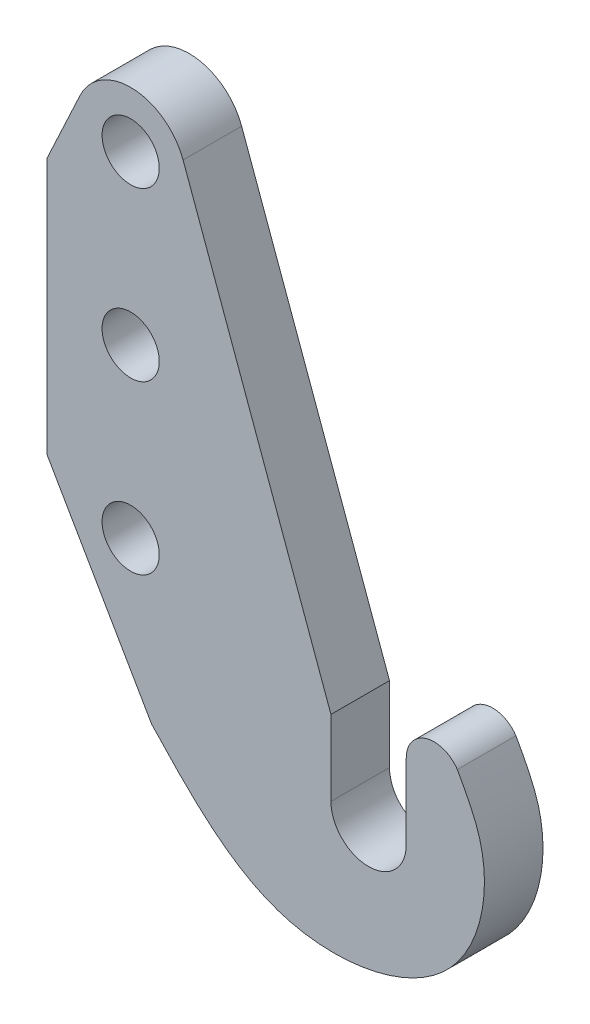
ISO-10303-21;
HEADER;
FILE_DESCRIPTION(('STEP AP214'),'2;1');
FILE_NAME('part.step','',(''),(''),'','','');
FILE_SCHEMA(('AUTOMOTIVE_DESIGN { 1 0 10303 214 1 1 1 1 }'));
ENDSEC;
DATA;
#1=APPLICATION_CONTEXT('core data for automotive mechanical design processes');
#2=APPLICATION_PROTOCOL_DEFINITION('international standard','automotive_design',2000,#1);
#3=PRODUCT_CONTEXT('',#1,'mechanical');
#4=PRODUCT('Part','Part','',(#3));
#5=PRODUCT_RELATED_PRODUCT_CATEGORY('part','',(#4));
#6=PRODUCT_DEFINITION_FORMATION('','',#4);
#7=PRODUCT_DEFINITION_CONTEXT('part definition',#1,'design');
#8=PRODUCT_DEFINITION('design','',#6,#7);
#9=PRODUCT_DEFINITION_SHAPE('','',#8);
#10=(LENGTH_UNIT() NAMED_UNIT(*) SI_UNIT(.MILLI.,.METRE.));
#11=(NAMED_UNIT(*) PLANE_ANGLE_UNIT() SI_UNIT($,.RADIAN.));
#12=(NAMED_UNIT(*) SI_UNIT($,.STERADIAN.) SOLID_ANGLE_UNIT());
#13=UNCERTAINTY_MEASURE_WITH_UNIT(LENGTH_MEASURE(1.E-05),#10,'distance_accuracy_value','');
#14=(GEOMETRIC_REPRESENTATION_CONTEXT(3) GLOBAL_UNCERTAINTY_ASSIGNED_CONTEXT((#13)) GLOBAL_UNIT_ASSIGNED_CONTEXT((#10,
#11,#12)) REPRESENTATION_CONTEXT('',''));
#15=CARTESIAN_POINT('',(0.,0.,0.));
#16=DIRECTION('',(0.,0.,1.));
#17=DIRECTION('',(1.,0.,0.));
#18=AXIS2_PLACEMENT_3D('',#15,#16,#17);
#19=CARTESIAN_POINT('',(90.2722291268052,-210.089311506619,21.));
#20=DIRECTION('',(0.,0.,-1.));
#21=DIRECTION('',(-1.,0.,0.));
#22=AXIS2_PLACEMENT_3D('',#19,#20,#21);
#23=PLANE('',#22);
#24=CARTESIAN_POINT('',(0.,-60.0000000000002,21.));
#25=DIRECTION('',(0.,0.,1.));
#26=DIRECTION('',(1.,0.,0.));
#27=AXIS2_PLACEMENT_3D('',#24,#25,#26);
#28=CIRCLE('',#27,10.25);
#29=CARTESIAN_POINT('',(-10.25,-60.0000000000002,21.));
#30=VERTEX_POINT('',#29);
#31=EDGE_CURVE('E244',#30,#30,#28,.T.);
#32=ORIENTED_EDGE('',*,*,#31,.F.);
#33=EDGE_LOOP('',(#32));
#34=FACE_BOUND('',#33,.T.);
#35=DIRECTION('',(0.500000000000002,-0.866025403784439,0.));
#36=VECTOR('',#35,1.);
#37=CARTESIAN_POINT('',(-30.0000000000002,-109.011175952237,21.));
#38=LINE('',#37,#36);
#39=CARTESIAN_POINT('',(-30.0000000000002,-109.011175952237,21.));
#40=VERTEX_POINT('',#39);
#41=CARTESIAN_POINT('',(7.49999999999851,-173.96308123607,21.));
#42=VERTEX_POINT('',#41);
#43=EDGE_CURVE('E166',#40,#42,#38,.T.);
#44=ORIENTED_EDGE('',*,*,#43,.T.);
#45=CARTESIAN_POINT('',(7.49999999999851,-173.96308123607,21.));
#46=CARTESIAN_POINT('',(21.9655402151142,-189.440634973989,20.9999999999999));
#47=CARTESIAN_POINT('',(51.0184942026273,-220.526142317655,21.));
#48=CARTESIAN_POINT('',(120.643530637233,-207.237177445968,21.));
#49=CARTESIAN_POINT('',(130.77861143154,-158.05215601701,21.));
#50=CARTESIAN_POINT('',(120.367683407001,-139.149758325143,21.));
#51=CARTESIAN_POINT('',(117.121833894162,-133.256495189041,21.));
#52=B_SPLINE_CURVE_WITH_KNOTS('',3,(#45,#46,#47,#48,#49,#50,#51),.UNSPECIFIED.,.F.,.F.,(4,1,1,1,
4),(0.,0.32627953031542,0.655307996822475,0.892534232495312,1.),.UNSPECIFIED.);
#53=CARTESIAN_POINT('',(117.121833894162,-133.256495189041,21.));
#54=VERTEX_POINT('',#53);
#55=EDGE_CURVE('E134',#42,#54,#52,.T.);
#56=ORIENTED_EDGE('',*,*,#55,.T.);
#57=CARTESIAN_POINT('',(108.806974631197,-138.811953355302,21.));
#58=DIRECTION('',(0.,0.,1.));
#59=DIRECTION('',(1.,0.,0.));
#60=AXIS2_PLACEMENT_3D('',#57,#58,#59);
#61=CIRCLE('',#60,10.);
#62=CARTESIAN_POINT('',(98.8069746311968,-138.811953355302,21.));
#63=VERTEX_POINT('',#62);
#64=EDGE_CURVE('E172',#54,#63,#61,.T.);
#65=ORIENTED_EDGE('',*,*,#64,.T.);
#66=DIRECTION('',(0.,-1.,0.));
#67=VECTOR('',#66,1.);
#68=CARTESIAN_POINT('',(98.8069746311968,-138.811953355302,21.));
#69=LINE('',#68,#67);
#70=CARTESIAN_POINT('',(98.8069746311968,-165.811953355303,21.));
#71=VERTEX_POINT('',#70);
#72=EDGE_CURVE('E259',#63,#71,#69,.T.);
#73=ORIENTED_EDGE('',*,*,#72,.T.);
#74=CARTESIAN_POINT('',(85.3069746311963,-165.811953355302,21.));
#75=DIRECTION('',(0.,0.,-1.));
#76=DIRECTION('',(1.,0.,0.));
#77=AXIS2_PLACEMENT_3D('',#74,#75,#76);
#78=CIRCLE('',#77,13.5);
#79=CARTESIAN_POINT('',(71.8069746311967,-165.811953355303,21.));
#80=VERTEX_POINT('',#79);
#81=EDGE_CURVE('E260',#71,#80,#78,.T.);
#82=ORIENTED_EDGE('',*,*,#81,.T.);
#83=DIRECTION('',(0.,1.,0.));
#84=VECTOR('',#83,1.);
#85=CARTESIAN_POINT('',(71.8069746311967,-138.811953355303,20.9999999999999));
#86=LINE('',#85,#84);
#87=CARTESIAN_POINT('',(71.8069746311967,-138.811953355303,20.9999999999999));
#88=VERTEX_POINT('',#87);
#89=EDGE_CURVE('E262',#80,#88,#86,.T.);
#90=ORIENTED_EDGE('',*,*,#89,.T.);
#91=DIRECTION('',(-0.34202014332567,0.939692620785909,0.));
#92=VECTOR('',#91,1.);
#93=CARTESIAN_POINT('',(18.7938524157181,6.84040286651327,21.));
#94=LINE('',#93,#92);
#95=CARTESIAN_POINT('',(18.7938524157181,6.84040286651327,21.));
#96=VERTEX_POINT('',#95);
#97=EDGE_CURVE('E266',#88,#96,#94,.T.);
#98=ORIENTED_EDGE('',*,*,#97,.T.);
#99=CARTESIAN_POINT('',(0.,0.,21.));
#100=DIRECTION('',(0.,0.,1.));
#101=DIRECTION('',(1.,0.,0.));
#102=AXIS2_PLACEMENT_3D('',#99,#100,#101);
#103=CIRCLE('',#102,20.);
#104=CARTESIAN_POINT('',(-18.1261557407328,8.45236523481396,21.));
#105=VERTEX_POINT('',#104);
#106=EDGE_CURVE('E268',#96,#105,#103,.T.);
#107=ORIENTED_EDGE('',*,*,#106,.T.);
#108=DIRECTION('',(-0.4226182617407,-0.90630778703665,0.));
#109=VECTOR('',#108,1.);
#110=CARTESIAN_POINT('',(-18.1261557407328,8.45236523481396,21.));
#111=LINE('',#110,#109);
#112=CARTESIAN_POINT('',(-30.0000000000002,-17.0111759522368,21.));
#113=VERTEX_POINT('',#112);
#114=EDGE_CURVE('E63',#105,#113,#111,.T.);
#115=ORIENTED_EDGE('',*,*,#114,.T.);
#116=DIRECTION('',(0.,-1.,0.));
#117=VECTOR('',#116,1.);
#118=CARTESIAN_POINT('',(-30.0000000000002,-17.0111759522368,21.));
#119=LINE('',#118,#117);
#120=EDGE_CURVE('E58',#113,#40,#119,.T.);
#121=ORIENTED_EDGE('',*,*,#120,.T.);
#122=EDGE_LOOP('',(#44,#56,#65,#73,#82,#90,#98,#107,#115,#121));
#123=FACE_BOUND('',#122,.T.);
#124=CARTESIAN_POINT('',(0.,0.,21.));
#125=DIRECTION('',(0.,0.,1.));
#126=DIRECTION('',(1.,0.,0.));
#127=AXIS2_PLACEMENT_3D('',#124,#125,#126);
#128=CIRCLE('',#127,10.25);
#129=CARTESIAN_POINT('',(-10.25,0.,21.));
#130=VERTEX_POINT('',#129);
#131=EDGE_CURVE('E139',#130,#130,#128,.T.);
#132=ORIENTED_EDGE('',*,*,#131,.F.);
#133=EDGE_LOOP('',(#132));
#134=FACE_BOUND('',#133,.T.);
#135=CARTESIAN_POINT('',(0.,-120.,21.));
#136=DIRECTION('',(0.,0.,1.));
#137=DIRECTION('',(1.,0.,0.));
#138=AXIS2_PLACEMENT_3D('',#135,#136,#137);
#139=CIRCLE('',#138,10.25);
#140=CARTESIAN_POINT('',(-10.25,-120.,21.));
#141=VERTEX_POINT('',#140);
#142=EDGE_CURVE('E233',#141,#141,#139,.T.);
#143=ORIENTED_EDGE('',*,*,#142,.F.);
#144=EDGE_LOOP('',(#143));
#145=FACE_BOUND('',#144,.T.);
#146=ADVANCED_FACE('F43',(#34,#123,#134,#145),#23,.F.);
#147=CARTESIAN_POINT('',(90.2722291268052,-210.089311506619,0.));
#148=DIRECTION('',(0.,0.,-1.));
#149=DIRECTION('',(-1.,0.,0.));
#150=AXIS2_PLACEMENT_3D('',#147,#148,#149);
#151=PLANE('',#150);
#152=CARTESIAN_POINT('',(0.,-60.0000000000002,0.));
#153=DIRECTION('',(0.,0.,1.));
#154=DIRECTION('',(1.,0.,0.));
#155=AXIS2_PLACEMENT_3D('',#152,#153,#154);
#156=CIRCLE('',#155,10.25);
#157=CARTESIAN_POINT('',(-10.25,-60.0000000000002,0.));
#158=VERTEX_POINT('',#157);
#159=EDGE_CURVE('E239',#158,#158,#156,.T.);
#160=ORIENTED_EDGE('',*,*,#159,.T.);
#161=EDGE_LOOP('',(#160));
#162=FACE_BOUND('',#161,.T.);
#163=DIRECTION('',(0.500000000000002,-0.866025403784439,0.));
#164=VECTOR('',#163,1.);
#165=CARTESIAN_POINT('',(-30.0000000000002,-109.011175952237,0.));
#166=LINE('',#165,#164);
#167=CARTESIAN_POINT('',(-30.0000000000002,-109.011175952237,0.));
#168=VERTEX_POINT('',#167);
#169=CARTESIAN_POINT('',(7.49999999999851,-173.963081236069,0.));
#170=VERTEX_POINT('',#169);
#171=EDGE_CURVE('E125',#168,#170,#166,.T.);
#172=ORIENTED_EDGE('',*,*,#171,.F.);
#173=DIRECTION('',(0.,-1.,0.));
#174=VECTOR('',#173,1.);
#175=CARTESIAN_POINT('',(-30.0000000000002,-17.0111759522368,0.));
#176=LINE('',#175,#174);
#177=CARTESIAN_POINT('',(-30.0000000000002,-17.0111759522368,0.));
#178=VERTEX_POINT('',#177);
#179=EDGE_CURVE('E164',#178,#168,#176,.T.);
#180=ORIENTED_EDGE('',*,*,#179,.F.);
#181=DIRECTION('',(-0.4226182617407,-0.90630778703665,0.));
#182=VECTOR('',#181,1.);
#183=CARTESIAN_POINT('',(-18.1261557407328,8.45236523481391,0.));
#184=LINE('',#183,#182);
#185=CARTESIAN_POINT('',(-18.1261557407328,8.45236523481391,0.));
#186=VERTEX_POINT('',#185);
#187=EDGE_CURVE('E162',#186,#178,#184,.T.);
#188=ORIENTED_EDGE('',*,*,#187,.F.);
#189=CARTESIAN_POINT('',(0.,0.,0.));
#190=DIRECTION('',(0.,0.,1.));
#191=DIRECTION('',(1.,0.,0.));
#192=AXIS2_PLACEMENT_3D('',#189,#190,#191);
#193=CIRCLE('',#192,20.);
#194=CARTESIAN_POINT('',(18.7938524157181,6.84040286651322,0.));
#195=VERTEX_POINT('',#194);
#196=EDGE_CURVE('E160',#195,#186,#193,.T.);
#197=ORIENTED_EDGE('',*,*,#196,.F.);
#198=DIRECTION('',(-0.34202014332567,0.939692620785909,0.));
#199=VECTOR('',#198,1.);
#200=CARTESIAN_POINT('',(18.7938524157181,6.84040286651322,0.));
#201=LINE('',#200,#199);
#202=CARTESIAN_POINT('',(71.8069746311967,-138.811953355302,-1.11022302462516E-13));
#203=VERTEX_POINT('',#202);
#204=EDGE_CURVE('E158',#203,#195,#201,.T.);
#205=ORIENTED_EDGE('',*,*,#204,.F.);
#206=DIRECTION('',(0.,1.,0.));
#207=VECTOR('',#206,1.);
#208=CARTESIAN_POINT('',(71.8069746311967,-138.811953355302,-1.11022302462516E-13));
#209=LINE('',#208,#207);
#210=CARTESIAN_POINT('',(71.8069746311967,-165.811953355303,0.));
#211=VERTEX_POINT('',#210);
#212=EDGE_CURVE('E156',#211,#203,#209,.T.);
#213=ORIENTED_EDGE('',*,*,#212,.F.);
#214=CARTESIAN_POINT('',(85.3069746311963,-165.811953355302,0.));
#215=DIRECTION('',(0.,0.,-1.));
#216=DIRECTION('',(1.,0.,0.));
#217=AXIS2_PLACEMENT_3D('',#214,#215,#216);
#218=CIRCLE('',#217,13.5);
#219=CARTESIAN_POINT('',(98.8069746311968,-165.811953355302,0.));
#220=VERTEX_POINT('',#219);
#221=EDGE_CURVE('E154',#220,#211,#218,.T.);
#222=ORIENTED_EDGE('',*,*,#221,.F.);
#223=DIRECTION('',(0.,-1.,0.));
#224=VECTOR('',#223,1.);
#225=CARTESIAN_POINT('',(98.8069746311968,-138.811953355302,0.));
#226=LINE('',#225,#224);
#227=CARTESIAN_POINT('',(98.8069746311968,-138.811953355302,0.));
#228=VERTEX_POINT('',#227);
#229=EDGE_CURVE('E152',#228,#220,#226,.T.);
#230=ORIENTED_EDGE('',*,*,#229,.F.);
#231=CARTESIAN_POINT('',(108.806974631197,-138.811953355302,0.));
#232=DIRECTION('',(0.,0.,1.));
#233=DIRECTION('',(1.,0.,0.));
#234=AXIS2_PLACEMENT_3D('',#231,#232,#233);
#235=CIRCLE('',#234,10.);
#236=CARTESIAN_POINT('',(117.121833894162,-133.25649518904,0.));
#237=VERTEX_POINT('',#236);
#238=EDGE_CURVE('E127',#237,#228,#235,.T.);
#239=ORIENTED_EDGE('',*,*,#238,.F.);
#240=CARTESIAN_POINT('',(7.49999999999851,-173.963081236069,0.));
#241=CARTESIAN_POINT('',(21.9655402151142,-189.440634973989,0.));
#242=CARTESIAN_POINT('',(51.0184942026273,-220.526142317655,0.));
#243=CARTESIAN_POINT('',(120.643530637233,-207.237177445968,0.));
#244=CARTESIAN_POINT('',(130.77861143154,-158.05215601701,0.));
#245=CARTESIAN_POINT('',(120.367683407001,-139.149758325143,0.));
#246=CARTESIAN_POINT('',(117.121833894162,-133.25649518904,0.));
#247=B_SPLINE_CURVE_WITH_KNOTS('',3,(#240,#241,#242,#243,#244,#245,#246),.UNSPECIFIED.,.F.,.F.,
(4,1,1,1,4),(0.,0.32627953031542,0.655307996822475,0.892534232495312,1.),.UNSPECIFIED.);
#248=EDGE_CURVE('E120',#170,#237,#247,.T.);
#249=ORIENTED_EDGE('',*,*,#248,.F.);
#250=EDGE_LOOP('',(#172,#180,#188,#197,#205,#213,#222,#230,#239,#249));
#251=FACE_BOUND('',#250,.T.);
#252=CARTESIAN_POINT('',(0.,0.,0.));
#253=DIRECTION('',(0.,0.,1.));
#254=DIRECTION('',(1.,0.,0.));
#255=AXIS2_PLACEMENT_3D('',#252,#253,#254);
#256=CIRCLE('',#255,10.25);
#257=CARTESIAN_POINT('',(-10.25,0.,0.));
#258=VERTEX_POINT('',#257);
#259=EDGE_CURVE('E142',#258,#258,#256,.T.);
#260=ORIENTED_EDGE('',*,*,#259,.T.);
#261=EDGE_LOOP('',(#260));
#262=FACE_BOUND('',#261,.T.);
#263=CARTESIAN_POINT('',(-1.77635683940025E-12,-120.,0.));
#264=DIRECTION('',(0.,0.,1.));
#265=DIRECTION('',(1.,0.,0.));
#266=AXIS2_PLACEMENT_3D('',#263,#264,#265);
#267=CIRCLE('',#266,10.25);
#268=CARTESIAN_POINT('',(-10.25,-120.,0.));
#269=VERTEX_POINT('',#268);
#270=EDGE_CURVE('E236',#269,#269,#267,.T.);
#271=ORIENTED_EDGE('',*,*,#270,.T.);
#272=EDGE_LOOP('',(#271));
#273=FACE_BOUND('',#272,.T.);
#274=ADVANCED_FACE('F121',(#162,#251,#262,#273),#151,.T.);
#275=CARTESIAN_POINT('',(-30.0000000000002,-109.011175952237,21.));
#276=DIRECTION('',(0.866025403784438,0.500000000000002,0.));
#277=DIRECTION('',(-0.500000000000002,0.866025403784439,0.));
#278=AXIS2_PLACEMENT_3D('',#275,#276,#277);
#279=PLANE('',#278);
#280=ORIENTED_EDGE('',*,*,#171,.T.);
#281=DIRECTION('',(0.,0.,-1.));
#282=VECTOR('',#281,1.);
#283=CARTESIAN_POINT('',(7.49999999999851,-173.96308123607,21.));
#284=LINE('',#283,#282);
#285=EDGE_CURVE('E13',#42,#170,#284,.T.);
#286=ORIENTED_EDGE('',*,*,#285,.F.);
#287=ORIENTED_EDGE('',*,*,#43,.F.);
#288=DIRECTION('',(0.,0.,-1.));
#289=VECTOR('',#288,1.);
#290=CARTESIAN_POINT('',(-30.0000000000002,-109.011175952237,21.));
#291=LINE('',#290,#289);
#292=EDGE_CURVE('E138',#40,#168,#291,.T.);
#293=ORIENTED_EDGE('',*,*,#292,.T.);
#294=EDGE_LOOP('',(#280,#286,#287,#293));
#295=FACE_BOUND('',#294,.T.);
#296=ADVANCED_FACE('F45',(#295),#279,.F.);
#297=DIRECTION('',(0.,0.,-1.));
#298=VECTOR('',#297,1.);
#299=SURFACE_OF_LINEAR_EXTRUSION('',#52,#298);
#300=ORIENTED_EDGE('',*,*,#248,.T.);
#301=DIRECTION('',(0.,0.,-1.));
#302=VECTOR('',#301,1.);
#303=CARTESIAN_POINT('',(117.121833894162,-133.256495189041,21.));
#304=LINE('',#303,#302);
#305=EDGE_CURVE('E51',#54,#237,#304,.T.);
#306=ORIENTED_EDGE('',*,*,#305,.F.);
#307=ORIENTED_EDGE('',*,*,#55,.F.);
#308=ORIENTED_EDGE('',*,*,#285,.T.);
#309=EDGE_LOOP('',(#300,#306,#307,#308));
#310=FACE_BOUND('',#309,.T.);
#311=ADVANCED_FACE('F133',(#310),#299,.F.);
#312=CARTESIAN_POINT('',(108.806974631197,-138.811953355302,21.));
#313=DIRECTION('',(0.,0.,-1.));
#314=DIRECTION('',(-1.,0.,0.));
#315=AXIS2_PLACEMENT_3D('',#312,#313,#314);
#316=CYLINDRICAL_SURFACE('',#315,10.);
#317=ORIENTED_EDGE('',*,*,#238,.T.);
#318=DIRECTION('',(0.,0.,-1.));
#319=VECTOR('',#318,1.);
#320=CARTESIAN_POINT('',(98.8069746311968,-138.811953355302,21.));
#321=LINE('',#320,#319);
#322=EDGE_CURVE('E256',#63,#228,#321,.T.);
#323=ORIENTED_EDGE('',*,*,#322,.F.);
#324=ORIENTED_EDGE('',*,*,#64,.F.);
#325=ORIENTED_EDGE('',*,*,#305,.T.);
#326=EDGE_LOOP('',(#317,#323,#324,#325));
#327=FACE_BOUND('',#326,.T.);
#328=ADVANCED_FACE('F179',(#327),#316,.T.);
#329=CARTESIAN_POINT('',(98.8069746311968,-138.811953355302,21.));
#330=DIRECTION('',(1.,0.,0.));
#331=DIRECTION('',(0.,0.,-1.));
#332=AXIS2_PLACEMENT_3D('',#329,#330,#331);
#333=PLANE('',#332);
#334=ORIENTED_EDGE('',*,*,#229,.T.);
#335=DIRECTION('',(0.,0.,-1.));
#336=VECTOR('',#335,1.);
#337=CARTESIAN_POINT('',(98.8069746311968,-165.811953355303,21.));
#338=LINE('',#337,#336);
#339=EDGE_CURVE('E288',#71,#220,#338,.T.);
#340=ORIENTED_EDGE('',*,*,#339,.F.);
#341=ORIENTED_EDGE('',*,*,#72,.F.);
#342=ORIENTED_EDGE('',*,*,#322,.T.);
#343=EDGE_LOOP('',(#334,#340,#341,#342));
#344=FACE_BOUND('',#343,.T.);
#345=ADVANCED_FACE('F182',(#344),#333,.F.);
#346=CARTESIAN_POINT('',(85.3069746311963,-165.811953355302,21.));
#347=DIRECTION('',(0.,0.,-1.));
#348=DIRECTION('',(-1.,0.,0.));
#349=AXIS2_PLACEMENT_3D('',#346,#347,#348);
#350=CYLINDRICAL_SURFACE('',#349,13.5);
#351=ORIENTED_EDGE('',*,*,#221,.T.);
#352=DIRECTION('',(0.,0.,-1.));
#353=VECTOR('',#352,1.);
#354=CARTESIAN_POINT('',(71.8069746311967,-165.811953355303,21.));
#355=LINE('',#354,#353);
#356=EDGE_CURVE('E285',#80,#211,#355,.T.);
#357=ORIENTED_EDGE('',*,*,#356,.F.);
#358=ORIENTED_EDGE('',*,*,#81,.F.);
#359=ORIENTED_EDGE('',*,*,#339,.T.);
#360=EDGE_LOOP('',(#351,#357,#358,#359));
#361=FACE_BOUND('',#360,.T.);
#362=ADVANCED_FACE('F186',(#361),#350,.F.);
#363=CARTESIAN_POINT('',(71.8069746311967,-138.811953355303,20.9999999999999));
#364=DIRECTION('',(-1.,0.,0.));
#365=DIRECTION('',(0.,0.,1.));
#366=AXIS2_PLACEMENT_3D('',#363,#364,#365);
#367=PLANE('',#366);
#368=ORIENTED_EDGE('',*,*,#212,.T.);
#369=DIRECTION('',(0.,0.,-1.));
#370=VECTOR('',#369,1.);
#371=CARTESIAN_POINT('',(71.8069746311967,-138.811953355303,20.9999999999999));
#372=LINE('',#371,#370);
#373=EDGE_CURVE('E282',#88,#203,#372,.T.);
#374=ORIENTED_EDGE('',*,*,#373,.F.);
#375=ORIENTED_EDGE('',*,*,#89,.F.);
#376=ORIENTED_EDGE('',*,*,#356,.T.);
#377=EDGE_LOOP('',(#368,#374,#375,#376));
#378=FACE_BOUND('',#377,.T.);
#379=ADVANCED_FACE('F190',(#378),#367,.F.);
#380=CARTESIAN_POINT('',(18.7938524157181,6.84040286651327,21.));
#381=DIRECTION('',(-0.939692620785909,-0.34202014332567,0.));
#382=DIRECTION('',(0.34202014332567,-0.939692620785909,0.));
#383=AXIS2_PLACEMENT_3D('',#380,#381,#382);
#384=PLANE('',#383);
#385=ORIENTED_EDGE('',*,*,#204,.T.);
#386=DIRECTION('',(0.,0.,-1.));
#387=VECTOR('',#386,1.);
#388=CARTESIAN_POINT('',(18.7938524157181,6.84040286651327,21.));
#389=LINE('',#388,#387);
#390=EDGE_CURVE('E279',#96,#195,#389,.T.);
#391=ORIENTED_EDGE('',*,*,#390,.F.);
#392=ORIENTED_EDGE('',*,*,#97,.F.);
#393=ORIENTED_EDGE('',*,*,#373,.T.);
#394=EDGE_LOOP('',(#385,#391,#392,#393));
#395=FACE_BOUND('',#394,.T.);
#396=ADVANCED_FACE('F194',(#395),#384,.F.);
#397=CARTESIAN_POINT('',(0.,0.,21.));
#398=DIRECTION('',(0.,0.,-1.));
#399=DIRECTION('',(-1.,0.,0.));
#400=AXIS2_PLACEMENT_3D('',#397,#398,#399);
#401=CYLINDRICAL_SURFACE('',#400,20.);
#402=ORIENTED_EDGE('',*,*,#196,.T.);
#403=DIRECTION('',(0.,0.,-1.));
#404=VECTOR('',#403,1.);
#405=CARTESIAN_POINT('',(-18.1261557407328,8.45236523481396,21.));
#406=LINE('',#405,#404);
#407=EDGE_CURVE('E276',#105,#186,#406,.T.);
#408=ORIENTED_EDGE('',*,*,#407,.F.);
#409=ORIENTED_EDGE('',*,*,#106,.F.);
#410=ORIENTED_EDGE('',*,*,#390,.T.);
#411=EDGE_LOOP('',(#402,#408,#409,#410));
#412=FACE_BOUND('',#411,.T.);
#413=ADVANCED_FACE('F198',(#412),#401,.T.);
#414=CARTESIAN_POINT('',(-18.1261557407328,8.45236523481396,21.));
#415=DIRECTION('',(0.90630778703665,-0.4226182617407,0.));
#416=DIRECTION('',(0.422618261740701,0.906307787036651,0.));
#417=AXIS2_PLACEMENT_3D('',#414,#415,#416);
#418=PLANE('',#417);
#419=ORIENTED_EDGE('',*,*,#187,.T.);
#420=DIRECTION('',(0.,0.,-1.));
#421=VECTOR('',#420,1.);
#422=CARTESIAN_POINT('',(-30.0000000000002,-17.0111759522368,21.));
#423=LINE('',#422,#421);
#424=EDGE_CURVE('E273',#113,#178,#423,.T.);
#425=ORIENTED_EDGE('',*,*,#424,.F.);
#426=ORIENTED_EDGE('',*,*,#114,.F.);
#427=ORIENTED_EDGE('',*,*,#407,.T.);
#428=EDGE_LOOP('',(#419,#425,#426,#427));
#429=FACE_BOUND('',#428,.T.);
#430=ADVANCED_FACE('F202',(#429),#418,.F.);
#431=CARTESIAN_POINT('',(-30.0000000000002,-17.0111759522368,21.));
#432=DIRECTION('',(1.,0.,0.));
#433=DIRECTION('',(0.,1.,0.));
#434=AXIS2_PLACEMENT_3D('',#431,#432,#433);
#435=PLANE('',#434);
#436=ORIENTED_EDGE('',*,*,#179,.T.);
#437=ORIENTED_EDGE('',*,*,#292,.F.);
#438=ORIENTED_EDGE('',*,*,#120,.F.);
#439=ORIENTED_EDGE('',*,*,#424,.T.);
#440=EDGE_LOOP('',(#436,#437,#438,#439));
#441=FACE_BOUND('',#440,.T.);
#442=ADVANCED_FACE('F206',(#441),#435,.F.);
#443=CARTESIAN_POINT('',(0.,0.,21.));
#444=DIRECTION('',(0.,0.,-1.));
#445=DIRECTION('',(-1.,0.,0.));
#446=AXIS2_PLACEMENT_3D('',#443,#444,#445);
#447=CYLINDRICAL_SURFACE('',#446,10.25);
#448=CARTESIAN_POINT('',(-10.25,0.,21.));
#449=CARTESIAN_POINT('',(-10.25,0.,20.78125));
#450=CARTESIAN_POINT('',(-10.25,0.,20.5625));
#451=CARTESIAN_POINT('',(-10.25,0.,20.125));
#452=CARTESIAN_POINT('',(-10.25,0.,19.90625));
#453=CARTESIAN_POINT('',(-10.25,0.,19.46875));
#454=CARTESIAN_POINT('',(-10.25,0.,19.25));
#455=CARTESIAN_POINT('',(-10.25,0.,18.8125));
#456=CARTESIAN_POINT('',(-10.25,0.,18.59375));
#457=CARTESIAN_POINT('',(-10.25,0.,18.15625));
#458=CARTESIAN_POINT('',(-10.25,0.,17.9375));
#459=CARTESIAN_POINT('',(-10.25,0.,17.5));
#460=CARTESIAN_POINT('',(-10.25,0.,17.28125));
#461=CARTESIAN_POINT('',(-10.25,0.,16.84375));
#462=CARTESIAN_POINT('',(-10.25,0.,16.625));
#463=CARTESIAN_POINT('',(-10.25,0.,16.1875));
#464=CARTESIAN_POINT('',(-10.25,0.,15.96875));
#465=CARTESIAN_POINT('',(-10.25,0.,15.53125));
#466=CARTESIAN_POINT('',(-10.25,0.,15.3125));
#467=CARTESIAN_POINT('',(-10.25,0.,14.875));
#468=CARTESIAN_POINT('',(-10.25,0.,14.65625));
#469=CARTESIAN_POINT('',(-10.25,0.,14.21875));
#470=CARTESIAN_POINT('',(-10.25,0.,14.));
#471=CARTESIAN_POINT('',(-10.25,0.,13.5625));
#472=CARTESIAN_POINT('',(-10.25,0.,13.34375));
#473=CARTESIAN_POINT('',(-10.25,0.,12.90625));
#474=CARTESIAN_POINT('',(-10.25,0.,12.6875));
#475=CARTESIAN_POINT('',(-10.25,0.,12.25));
#476=CARTESIAN_POINT('',(-10.25,0.,12.03125));
#477=CARTESIAN_POINT('',(-10.25,0.,11.59375));
#478=CARTESIAN_POINT('',(-10.25,0.,11.375));
#479=CARTESIAN_POINT('',(-10.25,0.,10.9375));
#480=CARTESIAN_POINT('',(-10.25,0.,10.71875));
#481=CARTESIAN_POINT('',(-10.25,0.,10.28125));
#482=CARTESIAN_POINT('',(-10.25,0.,10.0625));
#483=CARTESIAN_POINT('',(-10.25,0.,9.62500000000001));
#484=CARTESIAN_POINT('',(-10.25,0.,9.40625000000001));
#485=CARTESIAN_POINT('',(-10.25,0.,8.96875000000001));
#486=CARTESIAN_POINT('',(-10.25,0.,8.75));
#487=CARTESIAN_POINT('',(-10.25,0.,8.3125));
#488=CARTESIAN_POINT('',(-10.25,0.,8.09375));
#489=CARTESIAN_POINT('',(-10.25,0.,7.65625));
#490=CARTESIAN_POINT('',(-10.25,0.,7.4375));
#491=CARTESIAN_POINT('',(-10.25,0.,7.));
#492=CARTESIAN_POINT('',(-10.25,0.,6.78125));
#493=CARTESIAN_POINT('',(-10.25,0.,6.34375));
#494=CARTESIAN_POINT('',(-10.25,0.,6.125));
#495=CARTESIAN_POINT('',(-10.25,0.,5.6875));
#496=CARTESIAN_POINT('',(-10.25,0.,5.46875));
#497=CARTESIAN_POINT('',(-10.25,0.,5.03125));
#498=CARTESIAN_POINT('',(-10.25,0.,4.8125));
#499=CARTESIAN_POINT('',(-10.25,0.,4.375));
#500=CARTESIAN_POINT('',(-10.25,0.,4.15625));
#501=CARTESIAN_POINT('',(-10.25,0.,3.71875));
#502=CARTESIAN_POINT('',(-10.25,0.,3.5));
#503=CARTESIAN_POINT('',(-10.25,0.,3.0625));
#504=CARTESIAN_POINT('',(-10.25,0.,2.84375));
#505=CARTESIAN_POINT('',(-10.25,0.,2.40625));
#506=CARTESIAN_POINT('',(-10.25,0.,2.1875));
#507=CARTESIAN_POINT('',(-10.25,0.,1.75));
#508=CARTESIAN_POINT('',(-10.25,0.,1.53125));
#509=CARTESIAN_POINT('',(-10.25,0.,1.09375));
#510=CARTESIAN_POINT('',(-10.25,0.,0.874999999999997));
#511=CARTESIAN_POINT('',(-10.25,0.,0.437499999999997));
#512=CARTESIAN_POINT('',(-10.25,0.,0.218749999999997));
#513=CARTESIAN_POINT('',(-10.25,0.,0.));
#514=B_SPLINE_CURVE_WITH_KNOTS('',3,(#448,#449,#450,#451,#452,#453,#454,#455,#456,#457,#458,
#459,#460,#461,#462,#463,#464,#465,#466,#467,#468,#469,#470,#471,#472,#473,#474,#475,#476,#477,
#478,#479,#480,#481,#482,#483,#484,#485,#486,#487,#488,#489,#490,#491,#492,#493,#494,#495,#496,
#497,#498,#499,#500,#501,#502,#503,#504,#505,#506,#507,#508,#509,#510,#511,#512,#513),
.UNSPECIFIED.,.F.,.F.,(4,2,2,2,2,2,2,2,2,2,2,2,2,2,2,2,2,2,2,2,2,2,2,2,2,2,2,2,2,2,2,2,4),(0.,
0.656250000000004,1.3125,1.96875000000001,2.62500000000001,3.28125000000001,3.93750000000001,
4.59375000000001,5.25000000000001,5.90625000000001,6.56250000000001,7.21875000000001,
7.87500000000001,8.53125000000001,9.18750000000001,9.84375000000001,10.5,11.15625,11.8125,
12.46875,13.125,13.78125,14.4375,15.09375,15.75,16.40625,17.0625,17.71875,18.375,19.03125,
19.6875,20.34375,21.),.UNSPECIFIED.);
#515=EDGE_CURVE('BSEAM210',#130,#258,#514,.T.);
#516=ORIENTED_EDGE('',*,*,#131,.T.);
#517=ORIENTED_EDGE('',*,*,#259,.F.);
#518=ORIENTED_EDGE('',*,*,#515,.T.);
#519=ORIENTED_EDGE('',*,*,#515,.F.);
#520=EDGE_LOOP('',(#516,#518,#517,#519));
#521=FACE_BOUND('',#520,.T.);
#522=ADVANCED_FACE('F210',(#521),#447,.F.);
#523=CARTESIAN_POINT('',(0.,-60.0000000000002,21.));
#524=DIRECTION('',(0.,0.,-1.));
#525=DIRECTION('',(-1.,0.,0.));
#526=AXIS2_PLACEMENT_3D('',#523,#524,#525);
#527=CYLINDRICAL_SURFACE('',#526,10.25);
#528=CARTESIAN_POINT('',(-10.25,-60.0000000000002,21.));
#529=CARTESIAN_POINT('',(-10.25,-60.0000000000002,20.78125));
#530=CARTESIAN_POINT('',(-10.25,-60.0000000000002,20.5625));
#531=CARTESIAN_POINT('',(-10.25,-60.0000000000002,20.125));
#532=CARTESIAN_POINT('',(-10.25,-60.0000000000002,19.90625));
#533=CARTESIAN_POINT('',(-10.25,-60.0000000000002,19.46875));
#534=CARTESIAN_POINT('',(-10.25,-60.0000000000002,19.25));
#535=CARTESIAN_POINT('',(-10.25,-60.0000000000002,18.8125));
#536=CARTESIAN_POINT('',(-10.25,-60.0000000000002,18.59375));
#537=CARTESIAN_POINT('',(-10.25,-60.0000000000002,18.15625));
#538=CARTESIAN_POINT('',(-10.25,-60.0000000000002,17.9375));
#539=CARTESIAN_POINT('',(-10.25,-60.0000000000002,17.5));
#540=CARTESIAN_POINT('',(-10.25,-60.0000000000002,17.28125));
#541=CARTESIAN_POINT('',(-10.25,-60.0000000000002,16.84375));
#542=CARTESIAN_POINT('',(-10.25,-60.0000000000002,16.625));
#543=CARTESIAN_POINT('',(-10.25,-60.0000000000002,16.1875));
#544=CARTESIAN_POINT('',(-10.25,-60.0000000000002,15.96875));
#545=CARTESIAN_POINT('',(-10.25,-60.0000000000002,15.53125));
#546=CARTESIAN_POINT('',(-10.25,-60.0000000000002,15.3125));
#547=CARTESIAN_POINT('',(-10.25,-60.0000000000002,14.875));
#548=CARTESIAN_POINT('',(-10.25,-60.0000000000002,14.65625));
#549=CARTESIAN_POINT('',(-10.25,-60.0000000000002,14.21875));
#550=CARTESIAN_POINT('',(-10.25,-60.0000000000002,14.));
#551=CARTESIAN_POINT('',(-10.25,-60.0000000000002,13.5625));
#552=CARTESIAN_POINT('',(-10.25,-60.0000000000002,13.34375));
#553=CARTESIAN_POINT('',(-10.25,-60.0000000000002,12.90625));
#554=CARTESIAN_POINT('',(-10.25,-60.0000000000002,12.6875));
#555=CARTESIAN_POINT('',(-10.25,-60.0000000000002,12.25));
#556=CARTESIAN_POINT('',(-10.25,-60.0000000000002,12.03125));
#557=CARTESIAN_POINT('',(-10.25,-60.0000000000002,11.59375));
#558=CARTESIAN_POINT('',(-10.25,-60.0000000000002,11.375));
#559=CARTESIAN_POINT('',(-10.25,-60.0000000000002,10.9375));
#560=CARTESIAN_POINT('',(-10.25,-60.0000000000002,10.71875));
#561=CARTESIAN_POINT('',(-10.25,-60.0000000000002,10.28125));
#562=CARTESIAN_POINT('',(-10.25,-60.0000000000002,10.0625));
#563=CARTESIAN_POINT('',(-10.25,-60.0000000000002,9.62500000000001));
#564=CARTESIAN_POINT('',(-10.25,-60.0000000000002,9.40625000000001));
#565=CARTESIAN_POINT('',(-10.25,-60.0000000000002,8.96875000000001));
#566=CARTESIAN_POINT('',(-10.25,-60.0000000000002,8.75));
#567=CARTESIAN_POINT('',(-10.25,-60.0000000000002,8.3125));
#568=CARTESIAN_POINT('',(-10.25,-60.0000000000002,8.09375));
#569=CARTESIAN_POINT('',(-10.25,-60.0000000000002,7.65625));
#570=CARTESIAN_POINT('',(-10.25,-60.0000000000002,7.4375));
#571=CARTESIAN_POINT('',(-10.25,-60.0000000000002,7.));
#572=CARTESIAN_POINT('',(-10.25,-60.0000000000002,6.78125));
#573=CARTESIAN_POINT('',(-10.25,-60.0000000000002,6.34375));
#574=CARTESIAN_POINT('',(-10.25,-60.0000000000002,6.125));
#575=CARTESIAN_POINT('',(-10.25,-60.0000000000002,5.6875));
#576=CARTESIAN_POINT('',(-10.25,-60.0000000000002,5.46875));
#577=CARTESIAN_POINT('',(-10.25,-60.0000000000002,5.03125));
#578=CARTESIAN_POINT('',(-10.25,-60.0000000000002,4.8125));
#579=CARTESIAN_POINT('',(-10.25,-60.0000000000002,4.375));
#580=CARTESIAN_POINT('',(-10.25,-60.0000000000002,4.15625));
#581=CARTESIAN_POINT('',(-10.25,-60.0000000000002,3.71875));
#582=CARTESIAN_POINT('',(-10.25,-60.0000000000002,3.5));
#583=CARTESIAN_POINT('',(-10.25,-60.0000000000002,3.0625));
#584=CARTESIAN_POINT('',(-10.25,-60.0000000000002,2.84375));
#585=CARTESIAN_POINT('',(-10.25,-60.0000000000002,2.40625));
#586=CARTESIAN_POINT('',(-10.25,-60.0000000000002,2.1875));
#587=CARTESIAN_POINT('',(-10.25,-60.0000000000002,1.75));
#588=CARTESIAN_POINT('',(-10.25,-60.0000000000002,1.53125));
#589=CARTESIAN_POINT('',(-10.25,-60.0000000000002,1.09375));
#590=CARTESIAN_POINT('',(-10.25,-60.0000000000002,0.874999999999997));
#591=CARTESIAN_POINT('',(-10.25,-60.0000000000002,0.437499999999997));
#592=CARTESIAN_POINT('',(-10.25,-60.0000000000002,0.218749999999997));
#593=CARTESIAN_POINT('',(-10.25,-60.0000000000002,0.));
#594=B_SPLINE_CURVE_WITH_KNOTS('',3,(#528,#529,#530,#531,#532,#533,#534,#535,#536,#537,#538,
#539,#540,#541,#542,#543,#544,#545,#546,#547,#548,#549,#550,#551,#552,#553,#554,#555,#556,#557,
#558,#559,#560,#561,#562,#563,#564,#565,#566,#567,#568,#569,#570,#571,#572,#573,#574,#575,#576,
#577,#578,#579,#580,#581,#582,#583,#584,#585,#586,#587,#588,#589,#590,#591,#592,#593),
.UNSPECIFIED.,.F.,.F.,(4,2,2,2,2,2,2,2,2,2,2,2,2,2,2,2,2,2,2,2,2,2,2,2,2,2,2,2,2,2,2,2,4),(0.,
0.656250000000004,1.3125,1.96875000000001,2.62500000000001,3.28125000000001,3.93750000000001,
4.59375000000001,5.25000000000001,5.90625000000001,6.56250000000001,7.21875000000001,
7.87500000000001,8.53125000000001,9.18750000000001,9.84375000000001,10.5,11.15625,11.8125,
12.46875,13.125,13.78125,14.4375,15.09375,15.75,16.40625,17.0625,17.71875,18.375,19.03125,
19.6875,20.34375,21.),.UNSPECIFIED.);
#595=EDGE_CURVE('BSEAM220',#30,#158,#594,.T.);
#596=ORIENTED_EDGE('',*,*,#31,.T.);
#597=ORIENTED_EDGE('',*,*,#159,.F.);
#598=ORIENTED_EDGE('',*,*,#595,.T.);
#599=ORIENTED_EDGE('',*,*,#595,.F.);
#600=EDGE_LOOP('',(#596,#598,#597,#599));
#601=FACE_BOUND('',#600,.T.);
#602=ADVANCED_FACE('F220',(#601),#527,.F.);
#603=CARTESIAN_POINT('',(0.,-120.,21.));
#604=DIRECTION('',(0.,0.,-1.));
#605=DIRECTION('',(-1.,0.,0.));
#606=AXIS2_PLACEMENT_3D('',#603,#604,#605);
#607=CYLINDRICAL_SURFACE('',#606,10.25);
#608=CARTESIAN_POINT('',(-10.25,-120.,21.));
#609=CARTESIAN_POINT('',(-10.25,-120.,20.78125));
#610=CARTESIAN_POINT('',(-10.25,-120.,20.5625));
#611=CARTESIAN_POINT('',(-10.25,-120.,20.125));
#612=CARTESIAN_POINT('',(-10.25,-120.,19.90625));
#613=CARTESIAN_POINT('',(-10.25,-120.,19.46875));
#614=CARTESIAN_POINT('',(-10.25,-120.,19.25));
#615=CARTESIAN_POINT('',(-10.25,-120.,18.8125));
#616=CARTESIAN_POINT('',(-10.25,-120.,18.59375));
#617=CARTESIAN_POINT('',(-10.25,-120.,18.15625));
#618=CARTESIAN_POINT('',(-10.25,-120.,17.9375));
#619=CARTESIAN_POINT('',(-10.25,-120.,17.5));
#620=CARTESIAN_POINT('',(-10.25,-120.,17.28125));
#621=CARTESIAN_POINT('',(-10.25,-120.,16.84375));
#622=CARTESIAN_POINT('',(-10.25,-120.,16.625));
#623=CARTESIAN_POINT('',(-10.25,-120.,16.1875));
#624=CARTESIAN_POINT('',(-10.25,-120.,15.96875));
#625=CARTESIAN_POINT('',(-10.25,-120.,15.53125));
#626=CARTESIAN_POINT('',(-10.25,-120.,15.3125));
#627=CARTESIAN_POINT('',(-10.25,-120.,14.875));
#628=CARTESIAN_POINT('',(-10.25,-120.,14.65625));
#629=CARTESIAN_POINT('',(-10.25,-120.,14.21875));
#630=CARTESIAN_POINT('',(-10.25,-120.,14.));
#631=CARTESIAN_POINT('',(-10.25,-120.,13.5625));
#632=CARTESIAN_POINT('',(-10.25,-120.,13.34375));
#633=CARTESIAN_POINT('',(-10.25,-120.,12.90625));
#634=CARTESIAN_POINT('',(-10.25,-120.,12.6875));
#635=CARTESIAN_POINT('',(-10.25,-120.,12.25));
#636=CARTESIAN_POINT('',(-10.25,-120.,12.03125));
#637=CARTESIAN_POINT('',(-10.25,-120.,11.59375));
#638=CARTESIAN_POINT('',(-10.25,-120.,11.375));
#639=CARTESIAN_POINT('',(-10.25,-120.,10.9375));
#640=CARTESIAN_POINT('',(-10.25,-120.,10.71875));
#641=CARTESIAN_POINT('',(-10.25,-120.,10.28125));
#642=CARTESIAN_POINT('',(-10.25,-120.,10.0625));
#643=CARTESIAN_POINT('',(-10.25,-120.,9.62500000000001));
#644=CARTESIAN_POINT('',(-10.25,-120.,9.40625000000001));
#645=CARTESIAN_POINT('',(-10.25,-120.,8.96875000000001));
#646=CARTESIAN_POINT('',(-10.25,-120.,8.75));
#647=CARTESIAN_POINT('',(-10.25,-120.,8.3125));
#648=CARTESIAN_POINT('',(-10.25,-120.,8.09375));
#649=CARTESIAN_POINT('',(-10.25,-120.,7.65625));
#650=CARTESIAN_POINT('',(-10.25,-120.,7.4375));
#651=CARTESIAN_POINT('',(-10.25,-120.,7.));
#652=CARTESIAN_POINT('',(-10.25,-120.,6.78125));
#653=CARTESIAN_POINT('',(-10.25,-120.,6.34375));
#654=CARTESIAN_POINT('',(-10.25,-120.,6.125));
#655=CARTESIAN_POINT('',(-10.25,-120.,5.6875));
#656=CARTESIAN_POINT('',(-10.25,-120.,5.46875));
#657=CARTESIAN_POINT('',(-10.25,-120.,5.03125));
#658=CARTESIAN_POINT('',(-10.25,-120.,4.8125));
#659=CARTESIAN_POINT('',(-10.25,-120.,4.375));
#660=CARTESIAN_POINT('',(-10.25,-120.,4.15625));
#661=CARTESIAN_POINT('',(-10.25,-120.,3.71875));
#662=CARTESIAN_POINT('',(-10.25,-120.,3.5));
#663=CARTESIAN_POINT('',(-10.25,-120.,3.0625));
#664=CARTESIAN_POINT('',(-10.25,-120.,2.84375));
#665=CARTESIAN_POINT('',(-10.25,-120.,2.40625));
#666=CARTESIAN_POINT('',(-10.25,-120.,2.1875));
#667=CARTESIAN_POINT('',(-10.25,-120.,1.75));
#668=CARTESIAN_POINT('',(-10.25,-120.,1.53125));
#669=CARTESIAN_POINT('',(-10.25,-120.,1.09375));
#670=CARTESIAN_POINT('',(-10.25,-120.,0.874999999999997));
#671=CARTESIAN_POINT('',(-10.25,-120.,0.437499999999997));
#672=CARTESIAN_POINT('',(-10.25,-120.,0.218749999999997));
#673=CARTESIAN_POINT('',(-10.25,-120.,0.));
#674=B_SPLINE_CURVE_WITH_KNOTS('',3,(#608,#609,#610,#611,#612,#613,#614,#615,#616,#617,#618,
#619,#620,#621,#622,#623,#624,#625,#626,#627,#628,#629,#630,#631,#632,#633,#634,#635,#636,#637,
#638,#639,#640,#641,#642,#643,#644,#645,#646,#647,#648,#649,#650,#651,#652,#653,#654,#655,#656,
#657,#658,#659,#660,#661,#662,#663,#664,#665,#666,#667,#668,#669,#670,#671,#672,#673),
.UNSPECIFIED.,.F.,.F.,(4,2,2,2,2,2,2,2,2,2,2,2,2,2,2,2,2,2,2,2,2,2,2,2,2,2,2,2,2,2,2,2,4),(0.,
0.656250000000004,1.3125,1.96875000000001,2.62500000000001,3.28125000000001,3.93750000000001,
4.59375000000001,5.25000000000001,5.90625000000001,6.56250000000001,7.21875000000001,
7.87500000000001,8.53125000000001,9.18750000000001,9.84375000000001,10.5,11.15625,11.8125,
12.46875,13.125,13.78125,14.4375,15.09375,15.75,16.40625,17.0625,17.71875,18.375,19.03125,
19.6875,20.34375,21.),.UNSPECIFIED.);
#675=EDGE_CURVE('BSEAM224',#141,#269,#674,.T.);
#676=ORIENTED_EDGE('',*,*,#142,.T.);
#677=ORIENTED_EDGE('',*,*,#270,.F.);
#678=ORIENTED_EDGE('',*,*,#675,.T.);
#679=ORIENTED_EDGE('',*,*,#675,.F.);
#680=EDGE_LOOP('',(#676,#678,#677,#679));
#681=FACE_BOUND('',#680,.T.);
#682=ADVANCED_FACE('F224',(#681),#607,.F.);
#683=CLOSED_SHELL('',(#146,#274,#296,#311,#328,#345,#362,#379,#396,#413,#430,#442,#522,#602,#682));
#684=MANIFOLD_SOLID_BREP('B2',#683);
#685=ADVANCED_BREP_SHAPE_REPRESENTATION('',(#18,#684),#14);
#686=SHAPE_DEFINITION_REPRESENTATION(#9,#685);
ENDSEC;
END-ISO-10303-21;
